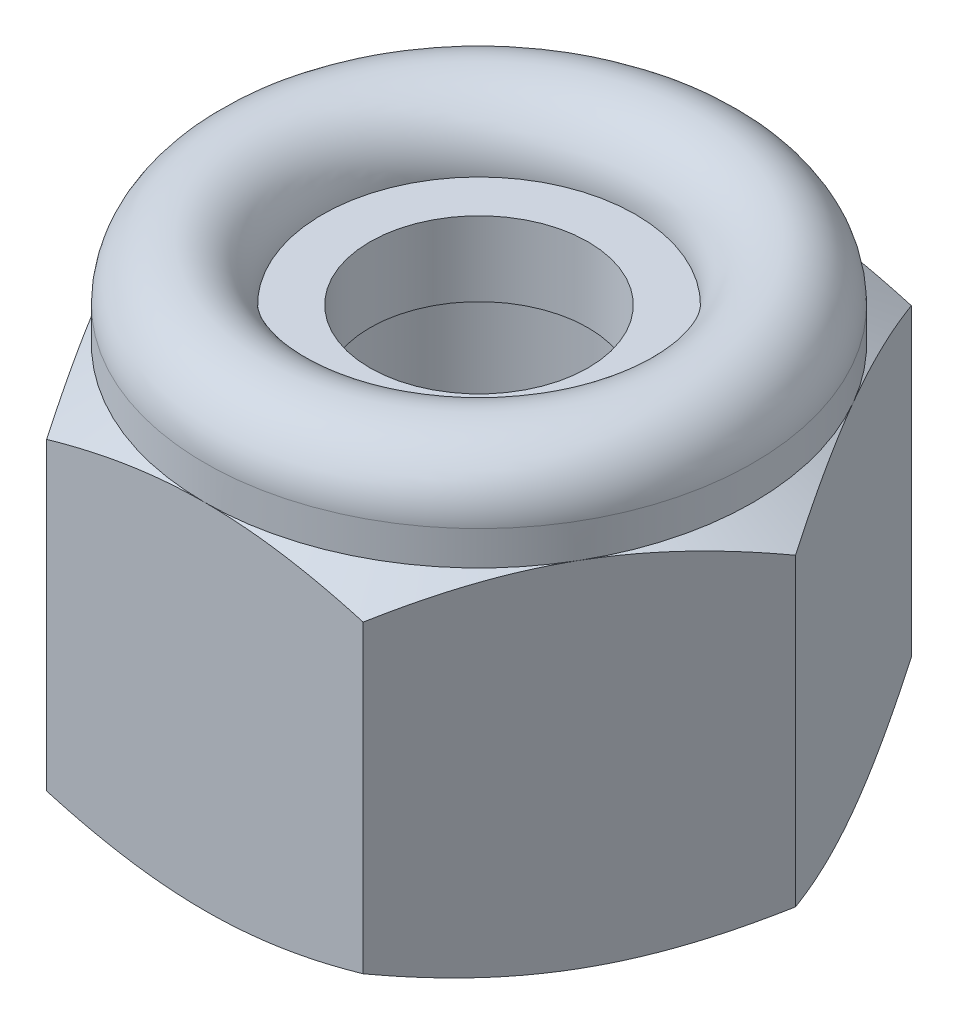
ISO-10303-21;
HEADER;
FILE_DESCRIPTION(('STEP AP214'),'2;1');
FILE_NAME('part.step','',(''),(''),'','','');
FILE_SCHEMA(('AUTOMOTIVE_DESIGN { 1 0 10303 214 1 1 1 1 }'));
ENDSEC;
DATA;
#1=APPLICATION_CONTEXT('core data for automotive mechanical design processes');
#2=APPLICATION_PROTOCOL_DEFINITION('international standard','automotive_design',2000,#1);
#3=PRODUCT_CONTEXT('',#1,'mechanical');
#4=PRODUCT('Part','Part','',(#3));
#5=PRODUCT_RELATED_PRODUCT_CATEGORY('part','',(#4));
#6=PRODUCT_DEFINITION_FORMATION('','',#4);
#7=PRODUCT_DEFINITION_CONTEXT('part definition',#1,'design');
#8=PRODUCT_DEFINITION('design','',#6,#7);
#9=PRODUCT_DEFINITION_SHAPE('','',#8);
#10=(LENGTH_UNIT() NAMED_UNIT(*) SI_UNIT(.MILLI.,.METRE.));
#11=(NAMED_UNIT(*) PLANE_ANGLE_UNIT() SI_UNIT($,.RADIAN.));
#12=(NAMED_UNIT(*) SI_UNIT($,.STERADIAN.) SOLID_ANGLE_UNIT());
#13=UNCERTAINTY_MEASURE_WITH_UNIT(LENGTH_MEASURE(1.E-05),#10,'distance_accuracy_value','');
#14=(GEOMETRIC_REPRESENTATION_CONTEXT(3) GLOBAL_UNCERTAINTY_ASSIGNED_CONTEXT((#13)) GLOBAL_UNIT_ASSIGNED_CONTEXT((#10,
#11,#12)) REPRESENTATION_CONTEXT('',''));
#15=CARTESIAN_POINT('',(0.,0.,0.));
#16=DIRECTION('',(0.,0.,1.));
#17=DIRECTION('',(1.,0.,0.));
#18=AXIS2_PLACEMENT_3D('',#15,#16,#17);
#19=CARTESIAN_POINT('',(0.,4.95,0.));
#20=DIRECTION('',(0.,-1.,0.));
#21=DIRECTION('',(0.,0.,-1.));
#22=AXIS2_PLACEMENT_3D('',#19,#20,#21);
#23=TOROIDAL_SURFACE('',#22,2.75,0.75);
#24=CARTESIAN_POINT('',(0.,4.95,0.));
#25=DIRECTION('',(0.,-1.,0.));
#26=DIRECTION('',(0.,0.,-1.));
#27=AXIS2_PLACEMENT_3D('',#24,#25,#26);
#28=CIRCLE('',#27,3.5);
#29=CARTESIAN_POINT('',(0.,4.95,-3.5));
#30=VERTEX_POINT('',#29);
#31=EDGE_CURVE('E175',#30,#30,#28,.T.);
#32=ORIENTED_EDGE('',*,*,#31,.F.);
#33=EDGE_LOOP('',(#32));
#34=FACE_BOUND('',#33,.T.);
#35=CARTESIAN_POINT('',(0.,4.95,0.));
#36=DIRECTION('',(0.,-1.,0.));
#37=DIRECTION('',(0.,0.,-1.));
#38=AXIS2_PLACEMENT_3D('',#35,#36,#37);
#39=CIRCLE('',#38,2.);
#40=CARTESIAN_POINT('',(0.,4.95,-2.));
#41=VERTEX_POINT('',#40);
#42=EDGE_CURVE('E20',#41,#41,#39,.T.);
#43=ORIENTED_EDGE('',*,*,#42,.T.);
#44=EDGE_LOOP('',(#43));
#45=FACE_BOUND('',#44,.T.);
#46=ADVANCED_FACE('F16',(#34,#45),#23,.T.);
#47=CARTESIAN_POINT('',(2.75,4.95,0.));
#48=DIRECTION('',(0.,-1.,0.));
#49=DIRECTION('',(0.,0.,-1.));
#50=AXIS2_PLACEMENT_3D('',#47,#48,#49);
#51=PLANE('',#50);
#52=CARTESIAN_POINT('',(0.,4.95,0.));
#53=DIRECTION('',(0.,-1.,0.));
#54=DIRECTION('',(0.,0.,-1.));
#55=AXIS2_PLACEMENT_3D('',#52,#53,#54);
#56=CIRCLE('',#55,1.393782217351);
#57=CARTESIAN_POINT('',(0.,4.95,-1.393782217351));
#58=VERTEX_POINT('',#57);
#59=EDGE_CURVE('E174',#58,#58,#56,.T.);
#60=ORIENTED_EDGE('',*,*,#59,.T.);
#61=EDGE_LOOP('',(#60));
#62=FACE_BOUND('',#61,.T.);
#63=ORIENTED_EDGE('',*,*,#42,.F.);
#64=EDGE_LOOP('',(#63));
#65=FACE_BOUND('',#64,.T.);
#66=ADVANCED_FACE('F386',(#62,#65),#51,.F.);
#67=CARTESIAN_POINT('',(0.,0.,0.));
#68=DIRECTION('',(0.,-1.,0.));
#69=DIRECTION('',(0.,0.,-1.));
#70=AXIS2_PLACEMENT_3D('',#67,#68,#69);
#71=CYLINDRICAL_SURFACE('',#70,3.5);
#72=CARTESIAN_POINT('',(0.,4.51443144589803,0.));
#73=DIRECTION('',(0.,-1.,0.));
#74=DIRECTION('',(0.,0.,-1.));
#75=AXIS2_PLACEMENT_3D('',#72,#73,#74);
#76=CIRCLE('',#75,3.49999999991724);
#77=CARTESIAN_POINT('',(0.,4.51443144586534,3.49999999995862));
#78=VERTEX_POINT('',#77);
#79=CARTESIAN_POINT('',(-3.03108891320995,4.51443144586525,1.74999999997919));
#80=VERTEX_POINT('',#79);
#81=EDGE_CURVE('E170',#78,#80,#76,.T.);
#82=ORIENTED_EDGE('',*,*,#81,.F.);
#83=CARTESIAN_POINT('',(0.,4.51443144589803,0.));
#84=DIRECTION('',(0.,-1.,0.));
#85=DIRECTION('',(0.,0.,-1.));
#86=AXIS2_PLACEMENT_3D('',#83,#84,#85);
#87=CIRCLE('',#86,3.49999999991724);
#88=CARTESIAN_POINT('',(3.03108891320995,4.51443144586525,1.74999999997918));
#89=VERTEX_POINT('',#88);
#90=EDGE_CURVE('E110',#89,#78,#87,.T.);
#91=ORIENTED_EDGE('',*,*,#90,.F.);
#92=CARTESIAN_POINT('',(0.,4.51443144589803,0.));
#93=DIRECTION('',(0.,-1.,0.));
#94=DIRECTION('',(0.,0.,-1.));
#95=AXIS2_PLACEMENT_3D('',#92,#93,#94);
#96=CIRCLE('',#95,3.49999999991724);
#97=CARTESIAN_POINT('',(3.03108891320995,4.51443144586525,-1.74999999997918));
#98=VERTEX_POINT('',#97);
#99=EDGE_CURVE('E162',#98,#89,#96,.T.);
#100=ORIENTED_EDGE('',*,*,#99,.F.);
#101=CARTESIAN_POINT('',(0.,4.51443144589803,0.));
#102=DIRECTION('',(0.,-1.,0.));
#103=DIRECTION('',(0.,0.,-1.));
#104=AXIS2_PLACEMENT_3D('',#101,#102,#103);
#105=CIRCLE('',#104,3.49999999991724);
#106=CARTESIAN_POINT('',(0.,4.51443144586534,-3.49999999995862));
#107=VERTEX_POINT('',#106);
#108=EDGE_CURVE('E159',#107,#98,#105,.T.);
#109=ORIENTED_EDGE('',*,*,#108,.F.);
#110=CARTESIAN_POINT('',(0.,4.51443144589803,0.));
#111=DIRECTION('',(0.,-1.,0.));
#112=DIRECTION('',(0.,0.,-1.));
#113=AXIS2_PLACEMENT_3D('',#110,#111,#112);
#114=CIRCLE('',#113,3.49999999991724);
#115=CARTESIAN_POINT('',(-3.03108891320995,4.51443144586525,-1.74999999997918));
#116=VERTEX_POINT('',#115);
#117=EDGE_CURVE('E164',#116,#107,#114,.T.);
#118=ORIENTED_EDGE('',*,*,#117,.F.);
#119=CARTESIAN_POINT('',(0.,4.51443144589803,0.));
#120=DIRECTION('',(0.,-1.,0.));
#121=DIRECTION('',(0.,0.,-1.));
#122=AXIS2_PLACEMENT_3D('',#119,#120,#121);
#123=CIRCLE('',#122,3.49999999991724);
#124=EDGE_CURVE('E167',#80,#116,#123,.T.);
#125=ORIENTED_EDGE('',*,*,#124,.F.);
#126=EDGE_LOOP('',(#82,#91,#100,#109,#118,#125));
#127=FACE_BOUND('',#126,.T.);
#128=ORIENTED_EDGE('',*,*,#31,.T.);
#129=EDGE_LOOP('',(#128));
#130=FACE_BOUND('',#129,.T.);
#131=ADVANCED_FACE('F390',(#127,#130),#71,.T.);
#132=CARTESIAN_POINT('',(0.,0.,0.));
#133=DIRECTION('',(0.,-1.,0.));
#134=DIRECTION('',(0.,0.,-1.));
#135=AXIS2_PLACEMENT_3D('',#132,#133,#134);
#136=CYLINDRICAL_SURFACE('',#135,1.393782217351);
#137=CARTESIAN_POINT('',(0.,4.,0.));
#138=DIRECTION('',(0.,-1.,0.));
#139=DIRECTION('',(0.,0.,-1.));
#140=AXIS2_PLACEMENT_3D('',#137,#138,#139);
#141=CIRCLE('',#140,1.393782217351);
#142=CARTESIAN_POINT('',(0.,4.,-1.393782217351));
#143=VERTEX_POINT('',#142);
#144=EDGE_CURVE('E123',#143,#143,#141,.F.);
#145=ORIENTED_EDGE('',*,*,#144,.F.);
#146=EDGE_LOOP('',(#145));
#147=FACE_BOUND('',#146,.T.);
#148=ORIENTED_EDGE('',*,*,#59,.F.);
#149=EDGE_LOOP('',(#148));
#150=FACE_BOUND('',#149,.T.);
#151=ADVANCED_FACE('F371',(#147,#150),#136,.F.);
#152=CARTESIAN_POINT('',(0.,4.19994841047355,0.));
#153=DIRECTION('',(0.,-1.,0.));
#154=DIRECTION('',(0.,0.,-1.));
#155=AXIS2_PLACEMENT_3D('',#152,#153,#154);
#156=CONICAL_SURFACE('',#155,4.04470059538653,1.04719755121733);
#157=ORIENTED_EDGE('',*,*,#90,.T.);
#158=CARTESIAN_POINT('',(0.,4.51443144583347,3.50000000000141));
#159=CARTESIAN_POINT('',(0.0857684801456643,4.51444575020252,3.5000000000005));
#160=CARTESIAN_POINT('',(0.171532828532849,4.51261159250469,3.50000000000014));
#161=CARTESIAN_POINT('',(0.34289312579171,4.50535267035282,3.49999999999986));
#162=CARTESIAN_POINT('',(0.428489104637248,4.49992861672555,3.49999999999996));
#163=CARTESIAN_POINT('',(0.598959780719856,4.48563193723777,3.50000000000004));
#164=CARTESIAN_POINT('',(0.683835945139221,4.4767766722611,3.50000000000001));
#165=CARTESIAN_POINT('',(0.853183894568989,4.45580805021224,3.49999999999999));
#166=CARTESIAN_POINT('',(0.937655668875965,4.44369460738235,3.5));
#167=CARTESIAN_POINT('',(1.19011426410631,4.40284122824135,3.50000000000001));
#168=CARTESIAN_POINT('',(1.35736768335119,4.36956840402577,3.5));
#169=CARTESIAN_POINT('',(1.69043621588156,4.29283276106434,3.5));
#170=CARTESIAN_POINT('',(1.85623971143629,4.24931905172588,3.49999999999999));
#171=CARTESIAN_POINT('',(2.02072594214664,4.2018240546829,3.5));
#172=B_SPLINE_CURVE_WITH_KNOTS('',3,(#158,#159,#160,#161,#162,#163,#164,#165,#166,#167,#168,
#169,#170,#171),.UNSPECIFIED.,.F.,.F.,(4,2,2,2,2,2,4),(0.,0.257279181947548,0.514507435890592,
0.770450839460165,1.026400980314,1.53763042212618,2.05145608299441),.UNSPECIFIED.);
#173=CARTESIAN_POINT('',(2.02072594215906,4.20182405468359,3.49999999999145));
#174=VERTEX_POINT('',#173);
#175=EDGE_CURVE('E104',#78,#174,#172,.T.);
#176=ORIENTED_EDGE('',*,*,#175,.T.);
#177=CARTESIAN_POINT('',(2.02072594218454,4.20182405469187,3.49999999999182));
#178=CARTESIAN_POINT('',(2.10296905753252,4.24931905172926,3.35755074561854));
#179=CARTESIAN_POINT('',(2.18587080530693,4.29283276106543,3.21396070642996));
#180=CARTESIAN_POINT('',(2.35240507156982,4.36956840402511,2.92551489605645));
#181=CARTESIAN_POINT('',(2.43603178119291,4.40284122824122,2.78066918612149));
#182=CARTESIAN_POINT('',(2.56226107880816,4.44369460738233,2.56203362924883));
#183=CARTESIAN_POINT('',(2.60449696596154,4.45580805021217,2.48887892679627));
#184=CARTESIAN_POINT('',(2.6891709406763,4.47677667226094,2.34221930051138));
#185=CARTESIAN_POINT('',(2.73160902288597,4.4856319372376,2.2687143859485));
#186=CARTESIAN_POINT('',(2.81684436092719,4.4999286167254,2.12108244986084));
#187=CARTESIAN_POINT('',(2.8596423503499,4.50535267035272,2.0469541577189));
#188=CARTESIAN_POINT('',(2.94532249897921,4.51261159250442,1.89855178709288));
#189=CARTESIAN_POINT('',(2.98820467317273,4.51444575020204,1.82427768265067));
#190=CARTESIAN_POINT('',(3.03108891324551,4.51443144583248,1.75000000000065));
#191=B_SPLINE_CURVE_WITH_KNOTS('',3,(#177,#178,#179,#180,#181,#182,#183,#184,#185,#186,#187,
#188,#189,#190),.UNSPECIFIED.,.F.,.F.,(4,2,2,2,2,2,4),(0.,0.513825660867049,1.02505510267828,
1.28100524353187,1.53694864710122,1.79417690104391,2.05145608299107),.UNSPECIFIED.);
#192=EDGE_CURVE('E107',#174,#89,#191,.T.);
#193=ORIENTED_EDGE('',*,*,#192,.T.);
#194=EDGE_LOOP('',(#157,#176,#193));
#195=FACE_BOUND('',#194,.T.);
#196=ADVANCED_FACE('F106',(#195),#156,.T.);
#197=CARTESIAN_POINT('',(0.,4.19994841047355,0.));
#198=DIRECTION('',(0.,-1.,0.));
#199=DIRECTION('',(0.,0.,-1.));
#200=AXIS2_PLACEMENT_3D('',#197,#198,#199);
#201=CONICAL_SURFACE('',#200,4.04470059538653,1.04719755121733);
#202=ORIENTED_EDGE('',*,*,#81,.T.);
#203=CARTESIAN_POINT('',(-3.03108891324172,4.51443144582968,1.74999999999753));
#204=CARTESIAN_POINT('',(-2.98820467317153,4.51444575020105,1.82427768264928));
#205=CARTESIAN_POINT('',(-2.94532249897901,4.51261159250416,1.89855178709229));
#206=CARTESIAN_POINT('',(-2.85964235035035,4.50535267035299,2.04695415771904));
#207=CARTESIAN_POINT('',(-2.81684436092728,4.49992861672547,2.12108244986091));
#208=CARTESIAN_POINT('',(-2.73160902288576,4.48563193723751,2.26871438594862));
#209=CARTESIAN_POINT('',(-2.68917094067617,4.47677667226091,2.34221930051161));
#210=CARTESIAN_POINT('',(-2.60449696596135,4.45580805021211,2.48887892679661));
#211=CARTESIAN_POINT('',(-2.56226107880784,4.4436946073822,2.56203362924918));
#212=CARTESIAN_POINT('',(-2.43603178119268,4.4028412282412,2.78066918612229));
#213=CARTESIAN_POINT('',(-2.35240507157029,4.36956840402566,2.92551489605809));
#214=CARTESIAN_POINT('',(-2.18587080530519,4.2928327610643,3.21396070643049));
#215=CARTESIAN_POINT('',(-2.10296905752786,4.24931905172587,3.35755074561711));
#216=CARTESIAN_POINT('',(-2.02072594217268,4.2018240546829,3.49999999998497));
#217=B_SPLINE_CURVE_WITH_KNOTS('',3,(#203,#204,#205,#206,#207,#208,#209,#210,#211,#212,#213,
#214,#215,#216),.UNSPECIFIED.,.F.,.F.,(4,2,2,2,2,2,4),(0.,0.257279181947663,0.514507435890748,
0.770450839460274,1.02640098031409,1.537630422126,2.05145608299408),.UNSPECIFIED.);
#218=CARTESIAN_POINT('',(-2.02072594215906,4.20182405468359,3.49999999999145));
#219=VERTEX_POINT('',#218);
#220=EDGE_CURVE('E132',#80,#219,#217,.T.);
#221=ORIENTED_EDGE('',*,*,#220,.T.);
#222=CARTESIAN_POINT('',(-2.02072594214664,4.20182405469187,3.5000000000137));
#223=CARTESIAN_POINT('',(-1.85623971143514,4.24931905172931,3.50000000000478));
#224=CARTESIAN_POINT('',(-1.69043621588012,4.29283276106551,3.50000000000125));
#225=CARTESIAN_POINT('',(-1.35736768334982,4.36956840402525,3.49999999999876));
#226=CARTESIAN_POINT('',(-1.1901142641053,4.40284122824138,3.49999999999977));
#227=CARTESIAN_POINT('',(-0.937655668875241,4.44369460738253,3.50000000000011));
#228=CARTESIAN_POINT('',(-0.85318389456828,4.45580805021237,3.50000000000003));
#229=CARTESIAN_POINT('',(-0.683835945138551,4.47677667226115,3.49999999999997));
#230=CARTESIAN_POINT('',(-0.598959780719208,4.48563193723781,3.49999999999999));
#231=CARTESIAN_POINT('',(-0.428489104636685,4.49992861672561,3.50000000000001));
#232=CARTESIAN_POINT('',(-0.342893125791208,4.50535267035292,3.5));
#233=CARTESIAN_POINT('',(-0.171532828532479,4.51261159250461,3.5));
#234=CARTESIAN_POINT('',(-0.0857684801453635,4.51444575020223,3.49999999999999));
#235=CARTESIAN_POINT('',(2.34930229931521E-13,4.51443144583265,3.5));
#236=B_SPLINE_CURVE_WITH_KNOTS('',3,(#222,#223,#224,#225,#226,#227,#228,#229,#230,#231,#232,
#233,#234,#235),.UNSPECIFIED.,.F.,.F.,(4,2,2,2,2,2,4),(0.,0.513825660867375,1.02505510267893,
1.28100524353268,1.53694864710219,1.79417690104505,2.05145608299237),.UNSPECIFIED.);
#237=EDGE_CURVE('E115',#219,#78,#236,.T.);
#238=ORIENTED_EDGE('',*,*,#237,.T.);
#239=EDGE_LOOP('',(#202,#221,#238));
#240=FACE_BOUND('',#239,.T.);
#241=ADVANCED_FACE('F370',(#240),#201,.T.);
#242=CARTESIAN_POINT('',(0.,4.19994841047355,0.));
#243=DIRECTION('',(0.,-1.,0.));
#244=DIRECTION('',(0.,0.,-1.));
#245=AXIS2_PLACEMENT_3D('',#242,#243,#244);
#246=CONICAL_SURFACE('',#245,4.04470059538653,1.04719755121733);
#247=ORIENTED_EDGE('',*,*,#124,.T.);
#248=CARTESIAN_POINT('',(-3.03108891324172,4.51443144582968,-1.74999999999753));
#249=CARTESIAN_POINT('',(-3.07397315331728,4.51444575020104,-1.67572231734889));
#250=CARTESIAN_POINT('',(-3.116855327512,4.51261159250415,-1.60144821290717));
#251=CARTESIAN_POINT('',(-3.20253547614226,4.50535267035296,-1.45304584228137));
#252=CARTESIAN_POINT('',(-3.24533346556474,4.49992861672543,-1.37891755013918));
#253=CARTESIAN_POINT('',(-3.33056880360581,4.48563193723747,-1.23128561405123));
#254=CARTESIAN_POINT('',(-3.37300688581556,4.47677667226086,-1.15778069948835));
#255=CARTESIAN_POINT('',(-3.45768086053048,4.45580805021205,-1.01112107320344));
#256=CARTESIAN_POINT('',(-3.49991674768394,4.44369460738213,-0.937966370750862));
#257=CARTESIAN_POINT('',(-3.62614604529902,4.40284122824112,-0.719330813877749));
#258=CARTESIAN_POINT('',(-3.70977275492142,4.36956840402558,-0.57448510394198));
#259=CARTESIAN_POINT('',(-3.87630702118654,4.29283276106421,-0.286039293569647));
#260=CARTESIAN_POINT('',(-3.95920876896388,4.24931905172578,-0.142449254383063));
#261=CARTESIAN_POINT('',(-4.04145188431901,4.20182405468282,-1.51997341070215E-11));
#262=B_SPLINE_CURVE_WITH_KNOTS('',3,(#248,#249,#250,#251,#252,#253,#254,#255,#256,#257,#258,
#259,#260,#261),.UNSPECIFIED.,.F.,.F.,(4,2,2,2,2,2,4),(0.,0.257279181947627,0.514507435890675,
0.770450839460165,1.02640098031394,1.53763042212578,2.05145608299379),.UNSPECIFIED.);
#263=CARTESIAN_POINT('',(-4.04145188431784,4.20182405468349,0.));
#264=VERTEX_POINT('',#263);
#265=EDGE_CURVE('E143',#116,#264,#262,.T.);
#266=ORIENTED_EDGE('',*,*,#265,.T.);
#267=CARTESIAN_POINT('',(-4.04145188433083,4.20182405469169,2.19108720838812E-11));
#268=CARTESIAN_POINT('',(-3.95920876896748,4.24931905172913,0.142449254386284));
#269=CARTESIAN_POINT('',(-3.87630702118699,4.29283276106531,0.28603929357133));
#270=CARTESIAN_POINT('',(-3.70977275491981,4.36956840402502,0.574485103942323));
#271=CARTESIAN_POINT('',(-3.62614604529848,4.40284122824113,0.719330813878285));
#272=CARTESIAN_POINT('',(-3.49991674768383,4.44369460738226,0.93796637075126));
#273=CARTESIAN_POINT('',(-3.45768086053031,4.45580805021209,1.01112107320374));
#274=CARTESIAN_POINT('',(-3.37300688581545,4.47677667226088,1.15778069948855));
#275=CARTESIAN_POINT('',(-3.33056880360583,4.48563193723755,1.23128561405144));
#276=CARTESIAN_POINT('',(-3.24533346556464,4.49992861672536,1.37891755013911));
#277=CARTESIAN_POINT('',(-3.20253547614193,4.50535267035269,1.45304584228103));
#278=CARTESIAN_POINT('',(-3.11685532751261,4.5126115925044,1.60144821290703));
#279=CARTESIAN_POINT('',(-3.07397315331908,4.51444575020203,1.67572231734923));
#280=CARTESIAN_POINT('',(-3.03108891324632,4.51443144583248,1.74999999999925));
#281=B_SPLINE_CURVE_WITH_KNOTS('',3,(#267,#268,#269,#270,#271,#272,#273,#274,#275,#276,#277,
#278,#279,#280),.UNSPECIFIED.,.F.,.F.,(4,2,2,2,2,2,4),(0.,0.513825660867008,1.0250551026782,
1.28100524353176,1.53694864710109,1.79417690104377,2.0514560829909),.UNSPECIFIED.);
#282=EDGE_CURVE('E129',#264,#80,#281,.T.);
#283=ORIENTED_EDGE('',*,*,#282,.T.);
#284=EDGE_LOOP('',(#247,#266,#283));
#285=FACE_BOUND('',#284,.T.);
#286=ADVANCED_FACE('F515',(#285),#246,.T.);
#287=CARTESIAN_POINT('',(0.,4.19994841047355,0.));
#288=DIRECTION('',(0.,-1.,0.));
#289=DIRECTION('',(0.,0.,-1.));
#290=AXIS2_PLACEMENT_3D('',#287,#288,#289);
#291=CONICAL_SURFACE('',#290,4.04470059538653,1.04719755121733);
#292=CARTESIAN_POINT('',(0.,4.51443144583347,-3.50000000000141));
#293=CARTESIAN_POINT('',(-0.0857684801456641,4.51444575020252,-3.5000000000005));
#294=CARTESIAN_POINT('',(-0.171532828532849,4.51261159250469,-3.50000000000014));
#295=CARTESIAN_POINT('',(-0.34289312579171,4.50535267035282,-3.49999999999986));
#296=CARTESIAN_POINT('',(-0.428489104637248,4.49992861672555,-3.49999999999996));
#297=CARTESIAN_POINT('',(-0.598959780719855,4.48563193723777,-3.50000000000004));
#298=CARTESIAN_POINT('',(-0.683835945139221,4.4767766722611,-3.50000000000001));
#299=CARTESIAN_POINT('',(-0.853183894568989,4.45580805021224,-3.49999999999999));
#300=CARTESIAN_POINT('',(-0.937655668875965,4.44369460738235,-3.5));
#301=CARTESIAN_POINT('',(-1.19011426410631,4.40284122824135,-3.50000000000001));
#302=CARTESIAN_POINT('',(-1.35736768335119,4.36956840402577,-3.5));
#303=CARTESIAN_POINT('',(-1.69043621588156,4.29283276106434,-3.5));
#304=CARTESIAN_POINT('',(-1.85623971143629,4.24931905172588,-3.49999999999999));
#305=CARTESIAN_POINT('',(-2.02072594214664,4.2018240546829,-3.5));
#306=B_SPLINE_CURVE_WITH_KNOTS('',3,(#292,#293,#294,#295,#296,#297,#298,#299,#300,#301,#302,
#303,#304,#305),.UNSPECIFIED.,.F.,.F.,(4,2,2,2,2,2,4),(0.,0.257279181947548,0.514507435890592,
0.770450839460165,1.026400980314,1.53763042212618,2.05145608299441),.UNSPECIFIED.);
#307=CARTESIAN_POINT('',(-2.02072594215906,4.20182405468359,-3.49999999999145));
#308=VERTEX_POINT('',#307);
#309=EDGE_CURVE('E147',#107,#308,#306,.T.);
#310=ORIENTED_EDGE('',*,*,#309,.T.);
#311=CARTESIAN_POINT('',(-2.02072594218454,4.20182405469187,-3.49999999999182));
#312=CARTESIAN_POINT('',(-2.10296905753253,4.24931905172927,-3.35755074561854));
#313=CARTESIAN_POINT('',(-2.18587080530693,4.29283276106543,-3.21396070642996));
#314=CARTESIAN_POINT('',(-2.35240507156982,4.36956840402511,-2.92551489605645));
#315=CARTESIAN_POINT('',(-2.43603178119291,4.40284122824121,-2.78066918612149));
#316=CARTESIAN_POINT('',(-2.56226107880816,4.44369460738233,-2.56203362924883));
#317=CARTESIAN_POINT('',(-2.60449696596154,4.45580805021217,-2.48887892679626));
#318=CARTESIAN_POINT('',(-2.6891709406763,4.47677667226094,-2.34221930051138));
#319=CARTESIAN_POINT('',(-2.73160902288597,4.4856319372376,-2.2687143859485));
#320=CARTESIAN_POINT('',(-2.81684436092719,4.4999286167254,-2.12108244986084));
#321=CARTESIAN_POINT('',(-2.8596423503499,4.50535267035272,-2.0469541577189));
#322=CARTESIAN_POINT('',(-2.94532249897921,4.51261159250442,-1.89855178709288));
#323=CARTESIAN_POINT('',(-2.98820467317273,4.51444575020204,-1.82427768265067));
#324=CARTESIAN_POINT('',(-3.03108891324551,4.51443144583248,-1.75000000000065));
#325=B_SPLINE_CURVE_WITH_KNOTS('',3,(#311,#312,#313,#314,#315,#316,#317,#318,#319,#320,#321,
#322,#323,#324),.UNSPECIFIED.,.F.,.F.,(4,2,2,2,2,2,4),(0.,0.513825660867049,1.02505510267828,
1.28100524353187,1.53694864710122,1.79417690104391,2.05145608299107),.UNSPECIFIED.);
#326=EDGE_CURVE('E139',#308,#116,#325,.T.);
#327=ORIENTED_EDGE('',*,*,#326,.T.);
#328=ORIENTED_EDGE('',*,*,#117,.T.);
#329=EDGE_LOOP('',(#310,#327,#328));
#330=FACE_BOUND('',#329,.T.);
#331=ADVANCED_FACE('F505',(#330),#291,.T.);
#332=CARTESIAN_POINT('',(0.,4.19994841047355,0.));
#333=DIRECTION('',(0.,-1.,0.));
#334=DIRECTION('',(0.,0.,-1.));
#335=AXIS2_PLACEMENT_3D('',#332,#333,#334);
#336=CONICAL_SURFACE('',#335,4.04470059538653,1.04719755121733);
#337=CARTESIAN_POINT('',(3.03108891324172,4.51443144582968,1.74999999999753));
#338=CARTESIAN_POINT('',(3.07397315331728,4.51444575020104,1.67572231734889));
#339=CARTESIAN_POINT('',(3.11685532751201,4.51261159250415,1.60144821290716));
#340=CARTESIAN_POINT('',(3.20253547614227,4.50535267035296,1.45304584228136));
#341=CARTESIAN_POINT('',(3.24533346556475,4.49992861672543,1.37891755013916));
#342=CARTESIAN_POINT('',(3.33056880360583,4.48563193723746,1.23128561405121));
#343=CARTESIAN_POINT('',(3.37300688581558,4.47677667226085,1.15778069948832));
#344=CARTESIAN_POINT('',(3.45768086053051,4.45580805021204,1.0111210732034));
#345=CARTESIAN_POINT('',(3.49991674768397,4.44369460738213,0.93796637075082));
#346=CARTESIAN_POINT('',(3.62614604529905,4.40284122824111,0.719330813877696));
#347=CARTESIAN_POINT('',(3.70977275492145,4.36956840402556,0.57448510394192));
#348=CARTESIAN_POINT('',(3.87630702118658,4.29283276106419,0.286039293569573));
#349=CARTESIAN_POINT('',(3.95920876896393,4.24931905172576,0.142449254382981));
#350=CARTESIAN_POINT('',(4.04145188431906,4.20182405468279,1.51111374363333E-11));
#351=B_SPLINE_CURVE_WITH_KNOTS('',3,(#337,#338,#339,#340,#341,#342,#343,#344,#345,#346,#347,
#348,#349,#350),.UNSPECIFIED.,.F.,.F.,(4,2,2,2,2,2,4),(0.,0.25727918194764,0.514507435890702,
0.770450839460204,1.026400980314,1.53763042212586,2.05145608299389),.UNSPECIFIED.);
#352=CARTESIAN_POINT('',(4.04145188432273,4.20182405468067,8.41392454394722E-12));
#353=VERTEX_POINT('',#352);
#354=EDGE_CURVE('E122',#89,#353,#351,.T.);
#355=ORIENTED_EDGE('',*,*,#354,.T.);
#356=CARTESIAN_POINT('',(4.04145188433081,4.20182405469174,-2.20158946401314E-11));
#357=CARTESIAN_POINT('',(3.95920876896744,4.24931905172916,-0.142449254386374));
#358=CARTESIAN_POINT('',(3.87630702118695,4.29283276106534,-0.286039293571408));
#359=CARTESIAN_POINT('',(3.70977275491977,4.36956840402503,-0.574485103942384));
#360=CARTESIAN_POINT('',(3.62614604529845,4.40284122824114,-0.719330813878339));
#361=CARTESIAN_POINT('',(3.49991674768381,4.44369460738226,-0.937966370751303));
#362=CARTESIAN_POINT('',(3.45768086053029,4.4558080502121,-1.01112107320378));
#363=CARTESIAN_POINT('',(3.37300688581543,4.47677667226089,-1.15778069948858));
#364=CARTESIAN_POINT('',(3.33056880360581,4.48563193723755,-1.23128561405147));
#365=CARTESIAN_POINT('',(3.24533346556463,4.49992861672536,-1.37891755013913));
#366=CARTESIAN_POINT('',(3.20253547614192,4.50535267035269,-1.45304584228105));
#367=CARTESIAN_POINT('',(3.11685532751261,4.5126115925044,-1.60144821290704));
#368=CARTESIAN_POINT('',(3.07397315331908,4.51444575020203,-1.67572231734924));
#369=CARTESIAN_POINT('',(3.03108891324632,4.51443144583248,-1.74999999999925));
#370=B_SPLINE_CURVE_WITH_KNOTS('',3,(#356,#357,#358,#359,#360,#361,#362,#363,#364,#365,#366,
#367,#368,#369),.UNSPECIFIED.,.F.,.F.,(4,2,2,2,2,2,4),(0.,0.513825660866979,1.02505510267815,
1.28100524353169,1.53694864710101,1.79417690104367,2.05145608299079),.UNSPECIFIED.);
#371=EDGE_CURVE('E153',#353,#98,#370,.T.);
#372=ORIENTED_EDGE('',*,*,#371,.T.);
#373=ORIENTED_EDGE('',*,*,#99,.T.);
#374=EDGE_LOOP('',(#355,#372,#373));
#375=FACE_BOUND('',#374,.T.);
#376=ADVANCED_FACE('F264',(#375),#336,.T.);
#377=CARTESIAN_POINT('',(0.,4.19994841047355,0.));
#378=DIRECTION('',(0.,-1.,0.));
#379=DIRECTION('',(0.,0.,-1.));
#380=AXIS2_PLACEMENT_3D('',#377,#378,#379);
#381=CONICAL_SURFACE('',#380,4.04470059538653,1.04719755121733);
#382=CARTESIAN_POINT('',(3.03108891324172,4.51443144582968,-1.74999999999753));
#383=CARTESIAN_POINT('',(2.98820467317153,4.51444575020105,-1.82427768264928));
#384=CARTESIAN_POINT('',(2.94532249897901,4.51261159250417,-1.89855178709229));
#385=CARTESIAN_POINT('',(2.85964235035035,4.50535267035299,-2.04695415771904));
#386=CARTESIAN_POINT('',(2.81684436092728,4.49992861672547,-2.12108244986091));
#387=CARTESIAN_POINT('',(2.73160902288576,4.48563193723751,-2.26871438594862));
#388=CARTESIAN_POINT('',(2.68917094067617,4.47677667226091,-2.34221930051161));
#389=CARTESIAN_POINT('',(2.60449696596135,4.45580805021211,-2.48887892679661));
#390=CARTESIAN_POINT('',(2.56226107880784,4.4436946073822,-2.56203362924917));
#391=CARTESIAN_POINT('',(2.43603178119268,4.4028412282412,-2.78066918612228));
#392=CARTESIAN_POINT('',(2.35240507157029,4.36956840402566,-2.92551489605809));
#393=CARTESIAN_POINT('',(2.18587080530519,4.2928327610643,-3.21396070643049));
#394=CARTESIAN_POINT('',(2.10296905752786,4.24931905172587,-3.35755074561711));
#395=CARTESIAN_POINT('',(2.02072594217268,4.2018240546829,-3.49999999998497));
#396=B_SPLINE_CURVE_WITH_KNOTS('',3,(#382,#383,#384,#385,#386,#387,#388,#389,#390,#391,#392,
#393,#394,#395),.UNSPECIFIED.,.F.,.F.,(4,2,2,2,2,2,4),(0.,0.257279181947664,0.514507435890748,
0.770450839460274,1.02640098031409,1.537630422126,2.05145608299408),.UNSPECIFIED.);
#397=CARTESIAN_POINT('',(2.02072594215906,4.20182405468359,-3.49999999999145));
#398=VERTEX_POINT('',#397);
#399=EDGE_CURVE('E151',#98,#398,#396,.T.);
#400=ORIENTED_EDGE('',*,*,#399,.T.);
#401=CARTESIAN_POINT('',(2.02072594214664,4.20182405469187,-3.5000000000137));
#402=CARTESIAN_POINT('',(1.85623971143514,4.24931905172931,-3.50000000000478));
#403=CARTESIAN_POINT('',(1.69043621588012,4.29283276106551,-3.50000000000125));
#404=CARTESIAN_POINT('',(1.35736768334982,4.36956840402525,-3.49999999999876));
#405=CARTESIAN_POINT('',(1.1901142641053,4.40284122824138,-3.49999999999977));
#406=CARTESIAN_POINT('',(0.937655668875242,4.44369460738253,-3.50000000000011));
#407=CARTESIAN_POINT('',(0.853183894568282,4.45580805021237,-3.50000000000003));
#408=CARTESIAN_POINT('',(0.683835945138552,4.47677667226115,-3.49999999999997));
#409=CARTESIAN_POINT('',(0.598959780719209,4.48563193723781,-3.49999999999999));
#410=CARTESIAN_POINT('',(0.428489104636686,4.49992861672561,-3.50000000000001));
#411=CARTESIAN_POINT('',(0.342893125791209,4.50535267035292,-3.5));
#412=CARTESIAN_POINT('',(0.17153282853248,4.51261159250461,-3.5));
#413=CARTESIAN_POINT('',(0.0857684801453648,4.51444575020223,-3.49999999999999));
#414=CARTESIAN_POINT('',(-2.33850580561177E-13,4.51443144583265,-3.5));
#415=B_SPLINE_CURVE_WITH_KNOTS('',3,(#401,#402,#403,#404,#405,#406,#407,#408,#409,#410,#411,
#412,#413,#414),.UNSPECIFIED.,.F.,.F.,(4,2,2,2,2,2,4),(0.,0.513825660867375,1.02505510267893,
1.28100524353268,1.53694864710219,1.79417690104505,2.05145608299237),.UNSPECIFIED.);
#416=EDGE_CURVE('E142',#398,#107,#415,.T.);
#417=ORIENTED_EDGE('',*,*,#416,.T.);
#418=ORIENTED_EDGE('',*,*,#108,.T.);
#419=EDGE_LOOP('',(#400,#417,#418));
#420=FACE_BOUND('',#419,.T.);
#421=ADVANCED_FACE('F259',(#420),#381,.T.);
#422=CARTESIAN_POINT('',(0.,4.,0.));
#423=DIRECTION('',(0.,-1.,0.));
#424=DIRECTION('',(0.,0.,-1.));
#425=AXIS2_PLACEMENT_3D('',#422,#423,#424);
#426=PLANE('',#425);
#427=ORIENTED_EDGE('',*,*,#144,.T.);
#428=EDGE_LOOP('',(#427));
#429=FACE_BOUND('',#428,.T.);
#430=CARTESIAN_POINT('',(0.,4.,0.));
#431=DIRECTION('',(0.,-1.,0.));
#432=DIRECTION('',(0.,0.,-1.));
#433=AXIS2_PLACEMENT_3D('',#430,#431,#432);
#434=CIRCLE('',#433,1.65);
#435=CARTESIAN_POINT('',(0.,4.,-1.65));
#436=VERTEX_POINT('',#435);
#437=EDGE_CURVE('E150',#436,#436,#434,.T.);
#438=ORIENTED_EDGE('',*,*,#437,.T.);
#439=EDGE_LOOP('',(#438));
#440=FACE_BOUND('',#439,.T.);
#441=ADVANCED_FACE('F263',(#429,#440),#426,.T.);
#442=CARTESIAN_POINT('',(2.020725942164,5.7,3.5));
#443=DIRECTION('',(-0.866025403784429,0.,-0.500000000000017));
#444=DIRECTION('',(-0.500000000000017,0.,0.866025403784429));
#445=AXIS2_PLACEMENT_3D('',#442,#443,#444);
#446=PLANE('',#445);
#447=DIRECTION('',(0.,1.,0.));
#448=VECTOR('',#447,1.);
#449=CARTESIAN_POINT('',(4.04145188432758,5.7,-3.37837396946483E-13));
#450=LINE('',#449,#448);
#451=CARTESIAN_POINT('',(4.04145186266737,0.312607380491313,3.75165958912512E-08));
#452=VERTEX_POINT('',#451);
#453=EDGE_CURVE('E146',#452,#353,#450,.T.);
#454=ORIENTED_EDGE('',*,*,#453,.T.);
#455=ORIENTED_EDGE('',*,*,#354,.F.);
#456=ORIENTED_EDGE('',*,*,#192,.F.);
#457=DIRECTION('',(0.,1.,0.));
#458=VECTOR('',#457,1.);
#459=CARTESIAN_POINT('',(2.020725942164,5.7,3.5));
#460=LINE('',#459,#458);
#461=CARTESIAN_POINT('',(2.02072595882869,0.31260739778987,3.5));
#462=VERTEX_POINT('',#461);
#463=EDGE_CURVE('E114',#174,#462,#460,.F.);
#464=ORIENTED_EDGE('',*,*,#463,.T.);
#465=CARTESIAN_POINT('',(3.03108891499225,-4.9321137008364E-09,1.75000000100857));
#466=CARTESIAN_POINT('',(2.98820467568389,-1.43085537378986E-05,1.8242776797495));
#467=CARTESIAN_POINT('',(2.94532250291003,0.00181984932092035,1.89855178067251));
#468=CARTESIAN_POINT('',(2.85964235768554,0.00907877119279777,2.04695414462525));
#469=CARTESIAN_POINT('',(2.81684437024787,0.0145028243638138,2.12108243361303));
#470=CARTESIAN_POINT('',(2.73160903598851,0.0287995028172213,2.26871436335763));
#471=CARTESIAN_POINT('',(2.68917095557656,0.0376547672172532,2.34221927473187));
#472=CARTESIAN_POINT('',(2.60449698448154,0.0586233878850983,2.4888788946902));
#473=CARTESIAN_POINT('',(2.56226109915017,0.070736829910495,2.56203359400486));
#474=CARTESIAN_POINT('',(2.43603180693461,0.111590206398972,2.78066914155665));
#475=CARTESIAN_POINT('',(2.35240510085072,0.144863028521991,2.92551484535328));
#476=CARTESIAN_POINT('',(2.18587084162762,0.221598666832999,3.21396064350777));
#477=CARTESIAN_POINT('',(2.10296909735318,0.2651123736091,3.35755067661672));
#478=CARTESIAN_POINT('',(2.02072598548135,0.312607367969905,3.49999992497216));
#479=B_SPLINE_CURVE_WITH_KNOTS('',3,(#465,#466,#467,#468,#469,#470,#471,#472,#473,#474,#475,
#476,#477,#478),.UNSPECIFIED.,.F.,.F.,(4,2,2,2,2,2,4),(0.,0.257279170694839,0.514507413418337,
0.77045080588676,1.02640093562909,1.53763035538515,2.0514559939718),.UNSPECIFIED.);
#480=CARTESIAN_POINT('',(3.031088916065,-1.88828992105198E-09,1.75000000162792));
#481=VERTEX_POINT('',#480);
#482=EDGE_CURVE('E576',#481,#462,#479,.T.);
#483=ORIENTED_EDGE('',*,*,#482,.F.);
#484=CARTESIAN_POINT('',(4.04145184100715,0.312607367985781,7.50335295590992E-08));
#485=CARTESIAN_POINT('',(3.95920872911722,0.265112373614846,0.142449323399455));
#486=CARTESIAN_POINT('',(3.87630698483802,0.221598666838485,0.28603935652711));
#487=CARTESIAN_POINT('',(3.70977272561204,0.144863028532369,0.574485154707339));
#488=CARTESIAN_POINT('',(3.62614601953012,0.111590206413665,0.719330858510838));
#489=CARTESIAN_POINT('',(3.49991672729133,0.0707368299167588,0.937966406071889));
#490=CARTESIAN_POINT('',(3.45768084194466,0.058623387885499,1.01112110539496));
#491=CARTESIAN_POINT('',(3.37300687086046,0.037654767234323,1.1577807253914));
#492=CARTESIAN_POINT('',(3.33056879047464,0.0287995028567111,1.23128563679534));
#493=CARTESIAN_POINT('',(3.24533345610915,0.0145028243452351,1.37891756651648));
#494=CARTESIAN_POINT('',(3.20253546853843,0.00907877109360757,1.45304585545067));
#495=CARTESIAN_POINT('',(3.11685532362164,0.00181984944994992,1.60144821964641));
#496=CARTESIAN_POINT('',(3.07397315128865,-1.43081154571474E-05,1.67572232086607));
#497=CARTESIAN_POINT('',(3.03108891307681,-3.7431297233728E-09,1.75000000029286));
#498=B_SPLINE_CURVE_WITH_KNOTS('',3,(#484,#485,#486,#487,#488,#489,#490,#491,#492,#493,#494,
#495,#496,#497),.UNSPECIFIED.,.F.,.F.,(4,2,2,2,2,2,4),(0.,0.513825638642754,1.0250550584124,
1.28100518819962,1.53694858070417,1.79417682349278,2.0514559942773),.UNSPECIFIED.);
#499=EDGE_CURVE('E237',#452,#481,#498,.T.);
#500=ORIENTED_EDGE('',*,*,#499,.F.);
#501=EDGE_LOOP('',(#454,#455,#456,#464,#483,#500));
#502=FACE_BOUND('',#501,.T.);
#503=ADVANCED_FACE('F120',(#502),#446,.F.);
#504=CARTESIAN_POINT('',(-2.020725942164,5.7,3.5));
#505=DIRECTION('',(0.,0.,-1.));
#506=DIRECTION('',(-1.,0.,0.));
#507=AXIS2_PLACEMENT_3D('',#504,#505,#506);
#508=PLANE('',#507);
#509=ORIENTED_EDGE('',*,*,#463,.F.);
#510=ORIENTED_EDGE('',*,*,#175,.F.);
#511=ORIENTED_EDGE('',*,*,#237,.F.);
#512=DIRECTION('',(0.,1.,0.));
#513=VECTOR('',#512,1.);
#514=CARTESIAN_POINT('',(-2.020725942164,5.7,3.5));
#515=LINE('',#514,#513);
#516=CARTESIAN_POINT('',(-2.02072593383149,0.312607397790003,3.50000001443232));
#517=VERTEX_POINT('',#516);
#518=EDGE_CURVE('E137',#219,#517,#515,.F.);
#519=ORIENTED_EDGE('',*,*,#518,.T.);
#520=CARTESIAN_POINT('',(0.,-4.88895138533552E-09,3.50000000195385));
#521=CARTESIAN_POINT('',(-0.0857684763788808,-1.43085338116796E-05,3.50000000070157));
#522=CARTESIAN_POINT('',(-0.171532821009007,0.00181984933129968,3.50000000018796));
#523=CARTESIAN_POINT('',(-0.34289311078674,0.00907877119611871,3.49999999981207));
#524=CARTESIAN_POINT('',(-0.428489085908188,0.0145028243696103,3.49999999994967));
#525=CARTESIAN_POINT('',(-0.598959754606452,0.0287995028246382,3.50000000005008));
#526=CARTESIAN_POINT('',(-0.683835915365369,0.0376547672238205,3.50000000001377));
#527=CARTESIAN_POINT('',(-0.85318385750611,0.0586233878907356,3.49999999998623));
#528=CARTESIAN_POINT('',(-0.937655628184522,0.0707368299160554,3.49999999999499));
#529=CARTESIAN_POINT('',(-1.19011421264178,0.111590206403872,3.50000000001));
#530=CARTESIAN_POINT('',(-1.35736762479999,0.144863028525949,3.50000000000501));
#531=CARTESIAN_POINT('',(-1.69043614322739,0.221598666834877,3.49999999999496));
#532=CARTESIAN_POINT('',(-1.85623963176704,0.265112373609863,3.4999999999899));
#533=CARTESIAN_POINT('',(-2.02072585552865,0.312607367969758,3.5));
#534=B_SPLINE_CURVE_WITH_KNOTS('',3,(#520,#521,#522,#523,#524,#525,#526,#527,#528,#529,#530,
#531,#532,#533),.UNSPECIFIED.,.F.,.F.,(4,2,2,2,2,2,4),(0.,0.257279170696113,0.514507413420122,
0.770450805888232,1.02640093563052,1.53763035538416,2.05145599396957),.UNSPECIFIED.);
#535=CARTESIAN_POINT('',(0.,-2.22943901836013E-09,3.50000000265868));
#536=VERTEX_POINT('',#535);
#537=EDGE_CURVE('E334',#536,#517,#534,.T.);
#538=ORIENTED_EDGE('',*,*,#537,.F.);
#539=CARTESIAN_POINT('',(2.02072597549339,0.312607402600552,3.5));
#540=CARTESIAN_POINT('',(1.85623974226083,0.265112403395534,3.5));
#541=CARTESIAN_POINT('',(1.6904362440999,0.221598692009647,3.5));
#542=CARTESIAN_POINT('',(1.3573677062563,0.144863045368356,3.5));
#543=CARTESIAN_POINT('',(1.1901142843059,0.111590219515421,3.5));
#544=CARTESIAN_POINT('',(0.937655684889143,0.0707368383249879,3.5));
#545=CARTESIAN_POINT('',(0.853183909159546,0.0586233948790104,3.5));
#546=CARTESIAN_POINT('',(0.683835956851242,0.0376547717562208,3.5));
#547=CARTESIAN_POINT('',(0.598959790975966,0.0287995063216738,3.5));
#548=CARTESIAN_POINT('',(0.428489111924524,0.0145028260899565,3.5));
#549=CARTESIAN_POINT('',(0.342893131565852,0.00907877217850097,3.5));
#550=CARTESIAN_POINT('',(0.171532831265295,0.00181984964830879,3.5));
#551=CARTESIAN_POINT('',(0.0857684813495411,-1.43081435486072E-05,3.5));
#552=CARTESIAN_POINT('',(-3.25131343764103E-10,-3.76796331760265E-09,3.5));
#553=B_SPLINE_CURVE_WITH_KNOTS('',3,(#539,#540,#541,#542,#543,#544,#545,#546,#547,#548,#549,
#550,#551,#552),.UNSPECIFIED.,.F.,.F.,(4,2,2,2,2,2,4),(0.,0.513825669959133,1.02505512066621,
1.28100526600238,1.53694867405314,1.79417693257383,2.05145611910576),.UNSPECIFIED.);
#554=EDGE_CURVE('E127',#462,#536,#553,.T.);
#555=ORIENTED_EDGE('',*,*,#554,.F.);
#556=EDGE_LOOP('',(#509,#510,#511,#519,#538,#555));
#557=FACE_BOUND('',#556,.T.);
#558=ADVANCED_FACE('F125',(#557),#508,.F.);
#559=CARTESIAN_POINT('',(-2.020725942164,5.7,3.5));
#560=DIRECTION('',(0.866025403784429,0.,-0.500000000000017));
#561=DIRECTION('',(-0.500000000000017,0.,-0.866025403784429));
#562=AXIS2_PLACEMENT_3D('',#559,#560,#561);
#563=PLANE('',#562);
#564=ORIENTED_EDGE('',*,*,#518,.F.);
#565=ORIENTED_EDGE('',*,*,#220,.F.);
#566=ORIENTED_EDGE('',*,*,#282,.F.);
#567=DIRECTION('',(0.,1.,0.));
#568=VECTOR('',#567,1.);
#569=CARTESIAN_POINT('',(-4.04145188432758,5.7,-3.37837396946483E-13));
#570=LINE('',#569,#568);
#571=CARTESIAN_POINT('',(-4.04145189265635,0.312607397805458,1.44254996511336E-08));
#572=VERTEX_POINT('',#571);
#573=EDGE_CURVE('E140',#264,#572,#570,.F.);
#574=ORIENTED_EDGE('',*,*,#573,.T.);
#575=CARTESIAN_POINT('',(-3.03108891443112,-4.56946868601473E-09,1.75000000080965));
#576=CARTESIAN_POINT('',(-3.07397315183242,-1.4308409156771E-05,1.67572232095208));
#577=CARTESIAN_POINT('',(-3.11685532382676,0.00181984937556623,1.60144821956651));
#578=CARTESIAN_POINT('',(-3.20253546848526,0.00907877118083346,1.45304585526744));
#579=CARTESIAN_POINT('',(-3.24533345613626,0.0145028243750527,1.37891756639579));
#580=CARTESIAN_POINT('',(-3.33056879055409,0.0287995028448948,1.2312856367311));
#581=CARTESIAN_POINT('',(-3.37300687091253,0.0376547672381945,1.15778072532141));
#582=CARTESIAN_POINT('',(-3.45768084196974,0.0586233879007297,1.01112110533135));
#583=CARTESIAN_POINT('',(-3.49991672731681,0.0707368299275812,0.937966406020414));
#584=CARTESIAN_POINT('',(-3.6261460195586,0.111590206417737,0.719330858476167));
#585=CARTESIAN_POINT('',(-3.7097727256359,0.144863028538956,0.574485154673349));
#586=CARTESIAN_POINT('',(-3.87630698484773,0.221598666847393,0.286039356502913));
#587=CARTESIAN_POINT('',(-3.95920872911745,0.265112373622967,0.142449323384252));
#588=CARTESIAN_POINT('',(-4.0414518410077,0.312607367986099,7.50325771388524E-08));
#589=B_SPLINE_CURVE_WITH_KNOTS('',3,(#575,#576,#577,#578,#579,#580,#581,#582,#583,#584,#585,
#586,#587,#588),.UNSPECIFIED.,.F.,.F.,(4,2,2,2,2,2,4),(0.,0.257279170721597,0.514507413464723,
0.770450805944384,1.02640093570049,1.53763035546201,2.05145599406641),.UNSPECIFIED.);
#590=CARTESIAN_POINT('',(-3.03108891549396,-2.217022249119E-09,1.75000000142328));
#591=VERTEX_POINT('',#590);
#592=EDGE_CURVE('E310',#591,#572,#589,.T.);
#593=ORIENTED_EDGE('',*,*,#592,.F.);
#594=CARTESIAN_POINT('',(-2.02072592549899,0.312607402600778,3.50000002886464));
#595=CARTESIAN_POINT('',(-2.10296904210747,0.265112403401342,3.35755077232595));
#596=CARTESIAN_POINT('',(-2.18587079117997,0.221598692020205,3.21396073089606));
#597=CARTESIAN_POINT('',(-2.35240506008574,0.144863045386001,2.92551491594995));
#598=CARTESIAN_POINT('',(-2.43603177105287,0.11159021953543,2.780669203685));
#599=CARTESIAN_POINT('',(-2.562261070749,0.0707368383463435,2.56203364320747));
#600=CARTESIAN_POINT('',(-2.60449695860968,0.0586233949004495,2.48887893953));
#601=CARTESIAN_POINT('',(-2.68917093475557,0.0376547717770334,2.34221931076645));
#602=CARTESIAN_POINT('',(-2.73160901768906,0.0287995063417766,2.26871439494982));
#603=CARTESIAN_POINT('',(-2.81684435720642,0.0145028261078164,2.12108245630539));
#604=CARTESIAN_POINT('',(-2.85964234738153,0.00907877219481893,2.04695416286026));
#605=CARTESIAN_POINT('',(-2.94532249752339,0.00181984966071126,1.89855178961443));
#606=CARTESIAN_POINT('',(-2.98820467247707,-1.4308133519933E-05,1.8242776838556));
#607=CARTESIAN_POINT('',(-3.03108891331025,-3.76071716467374E-09,1.74999999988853));
#608=B_SPLINE_CURVE_WITH_KNOTS('',3,(#594,#595,#596,#597,#598,#599,#600,#601,#602,#603,#604,
#605,#606,#607),.UNSPECIFIED.,.F.,.F.,(4,2,2,2,2,2,4),(0.,0.513825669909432,1.02505512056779,
1.28100526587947,1.53694867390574,1.79417693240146,2.0514561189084),.UNSPECIFIED.);
#609=EDGE_CURVE('E329',#517,#591,#608,.T.);
#610=ORIENTED_EDGE('',*,*,#609,.F.);
#611=EDGE_LOOP('',(#564,#565,#566,#574,#593,#610));
#612=FACE_BOUND('',#611,.T.);
#613=ADVANCED_FACE('F347',(#612),#563,.F.);
#614=CARTESIAN_POINT('',(-2.020725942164,5.7,-3.5));
#615=DIRECTION('',(0.866025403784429,0.,0.500000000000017));
#616=DIRECTION('',(0.500000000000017,0.,-0.866025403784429));
#617=AXIS2_PLACEMENT_3D('',#614,#615,#616);
#618=PLANE('',#617);
#619=ORIENTED_EDGE('',*,*,#573,.F.);
#620=ORIENTED_EDGE('',*,*,#265,.F.);
#621=ORIENTED_EDGE('',*,*,#326,.F.);
#622=DIRECTION('',(0.,1.,0.));
#623=VECTOR('',#622,1.);
#624=CARTESIAN_POINT('',(-2.020725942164,5.7,-3.5));
#625=LINE('',#624,#623);
#626=CARTESIAN_POINT('',(-2.02072595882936,0.312607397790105,-3.5));
#627=VERTEX_POINT('',#626);
#628=EDGE_CURVE('E144',#308,#627,#625,.F.);
#629=ORIENTED_EDGE('',*,*,#628,.T.);
#630=CARTESIAN_POINT('',(-3.0310889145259,-4.5826018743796E-09,-1.75000000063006));
#631=CARTESIAN_POINT('',(-2.98820467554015,-1.43084249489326E-05,-1.82427767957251));
#632=CARTESIAN_POINT('',(-2.94532250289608,0.00181984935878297,-1.89855178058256));
#633=CARTESIAN_POINT('',(-2.85964235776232,0.00907877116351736,-2.04695414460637));
#634=CARTESIAN_POINT('',(-2.81684437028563,0.0145028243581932,-2.12108243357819));
#635=CARTESIAN_POINT('',(-2.73160903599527,0.0287995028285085,-2.26871436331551));
#636=CARTESIAN_POINT('',(-2.68917095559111,0.0376547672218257,-2.34221927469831));
#637=CARTESIAN_POINT('',(-2.60449698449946,0.0586233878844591,-2.48887889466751));
#638=CARTESIAN_POINT('',(-2.56226109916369,0.0707368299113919,-2.56203359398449));
#639=CARTESIAN_POINT('',(-2.43603180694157,0.111590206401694,-2.78066914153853));
#640=CARTESIAN_POINT('',(-2.35240510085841,0.144863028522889,-2.9255148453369));
#641=CARTESIAN_POINT('',(-2.18587084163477,0.221598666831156,-3.21396064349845));
#642=CARTESIAN_POINT('',(-2.10296909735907,0.265112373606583,-3.35755067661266));
#643=CARTESIAN_POINT('',(-2.02072598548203,0.312607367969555,-3.49999992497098));
#644=B_SPLINE_CURVE_WITH_KNOTS('',3,(#630,#631,#632,#633,#634,#635,#636,#637,#638,#639,#640,
#641,#642,#643),.UNSPECIFIED.,.F.,.F.,(4,2,2,2,2,2,4),(0.,0.257279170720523,0.51450741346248,
0.770450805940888,1.02640093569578,1.53763035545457,2.05145599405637),.UNSPECIFIED.);
#645=CARTESIAN_POINT('',(-3.03108891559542,-2.22581594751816E-09,-1.75000000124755));
#646=VERTEX_POINT('',#645);
#647=EDGE_CURVE('E298',#646,#627,#644,.T.);
#648=ORIENTED_EDGE('',*,*,#647,.F.);
#649=CARTESIAN_POINT('',(-4.04145190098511,0.312607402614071,2.88513370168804E-08));
#650=CARTESIAN_POINT('',(-3.95920878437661,0.265112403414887,-0.142449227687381));
#651=CARTESIAN_POINT('',(-3.87630703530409,0.221598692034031,-0.286039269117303));
#652=CARTESIAN_POINT('',(-3.7097727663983,0.144863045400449,-0.574485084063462));
#653=CARTESIAN_POINT('',(-3.62614605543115,0.111590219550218,-0.719330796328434));
#654=CARTESIAN_POINT('',(-3.49991675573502,0.0707368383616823,-0.937966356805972));
#655=CARTESIAN_POINT('',(-3.45768086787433,0.0586233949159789,-1.01112106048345));
#656=CARTESIAN_POINT('',(-3.37300689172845,0.0376547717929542,-1.157780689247));
#657=CARTESIAN_POINT('',(-3.33056880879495,0.0287995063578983,-1.23128560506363));
#658=CARTESIAN_POINT('',(-3.2453334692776,0.0145028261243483,-1.37891754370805));
#659=CARTESIAN_POINT('',(-3.20253547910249,0.00907877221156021,-1.45304583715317));
#660=CARTESIAN_POINT('',(-3.11685532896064,0.00181984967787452,-1.60144821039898));
#661=CARTESIAN_POINT('',(-3.07397315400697,-1.43081161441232E-05,-1.6757223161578));
#662=CARTESIAN_POINT('',(-3.03108891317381,-3.74312968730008E-09,-1.75000000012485));
#663=B_SPLINE_CURVE_WITH_KNOTS('',3,(#649,#650,#651,#652,#653,#654,#655,#656,#657,#658,#659,
#660,#661,#662),.UNSPECIFIED.,.F.,.F.,(4,2,2,2,2,2,4),(0.,0.513825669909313,1.02505512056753,
1.28100526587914,1.53694867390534,1.794176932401,2.05145611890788),.UNSPECIFIED.);
#664=EDGE_CURVE('E304',#572,#646,#663,.T.);
#665=ORIENTED_EDGE('',*,*,#664,.F.);
#666=EDGE_LOOP('',(#619,#620,#621,#629,#648,#665));
#667=FACE_BOUND('',#666,.T.);
#668=ADVANCED_FACE('F287',(#667),#618,.F.);
#669=CARTESIAN_POINT('',(-2.020725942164,5.7,-3.5));
#670=DIRECTION('',(0.,0.,1.));
#671=DIRECTION('',(1.,0.,0.));
#672=AXIS2_PLACEMENT_3D('',#669,#670,#671);
#673=PLANE('',#672);
#674=ORIENTED_EDGE('',*,*,#628,.F.);
#675=ORIENTED_EDGE('',*,*,#309,.F.);
#676=ORIENTED_EDGE('',*,*,#416,.F.);
#677=DIRECTION('',(0.,1.,0.));
#678=VECTOR('',#677,1.);
#679=CARTESIAN_POINT('',(2.020725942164,5.7,-3.5));
#680=LINE('',#679,#678);
#681=CARTESIAN_POINT('',(2.02072593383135,0.312607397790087,-3.50000001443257));
#682=VERTEX_POINT('',#681);
#683=EDGE_CURVE('E148',#398,#682,#680,.F.);
#684=ORIENTED_EDGE('',*,*,#683,.T.);
#685=CARTESIAN_POINT('',(1.99183769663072E-10,-4.58401972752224E-09,-3.50000000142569));
#686=CARTESIAN_POINT('',(0.0857684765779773,-1.43084214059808E-05,-3.50000000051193));
#687=CARTESIAN_POINT('',(0.171532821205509,0.00181984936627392,-3.50000000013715));
#688=CARTESIAN_POINT('',(0.342893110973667,0.00907877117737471,-3.49999999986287));
#689=CARTESIAN_POINT('',(0.428489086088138,0.0145028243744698,-3.49999999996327));
#690=CARTESIAN_POINT('',(0.598959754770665,0.0287995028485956,-3.50000000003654));
#691=CARTESIAN_POINT('',(0.683835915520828,0.0376547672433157,-3.50000000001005));
#692=CARTESIAN_POINT('',(0.853183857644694,0.0586233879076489,-3.49999999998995));
#693=CARTESIAN_POINT('',(0.937655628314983,0.0707368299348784,-3.49999999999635));
#694=CARTESIAN_POINT('',(1.19011421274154,0.111590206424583,-3.5000000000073));
#695=CARTESIAN_POINT('',(1.35736762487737,0.14486302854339,-3.50000000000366));
#696=CARTESIAN_POINT('',(1.69043614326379,0.221598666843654,-3.49999999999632));
#697=CARTESIAN_POINT('',(1.85623963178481,0.265112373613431,-3.49999999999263));
#698=CARTESIAN_POINT('',(2.02072585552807,0.312607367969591,-3.5));
#699=B_SPLINE_CURVE_WITH_KNOTS('',3,(#685,#686,#687,#688,#689,#690,#691,#692,#693,#694,#695,
#696,#697,#698),.UNSPECIFIED.,.F.,.F.,(4,2,2,2,2,2,4),(0.,0.257279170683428,0.514507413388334,
0.770450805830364,1.02640093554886,1.53763035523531,2.05145599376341),.UNSPECIFIED.);
#700=CARTESIAN_POINT('',(1.99183878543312E-10,-2.22590446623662E-09,-3.50000000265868));
#701=VERTEX_POINT('',#700);
#702=EDGE_CURVE('E35',#701,#682,#699,.T.);
#703=ORIENTED_EDGE('',*,*,#702,.F.);
#704=CARTESIAN_POINT('',(-2.02072597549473,0.312607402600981,-3.5));
#705=CARTESIAN_POINT('',(-1.85623974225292,0.265112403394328,-3.5));
#706=CARTESIAN_POINT('',(-1.69043624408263,0.221598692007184,-3.5));
#707=CARTESIAN_POINT('',(-1.35736770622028,0.144863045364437,-3.5));
#708=CARTESIAN_POINT('',(-1.1901142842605,0.111590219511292,-3.5));
#709=CARTESIAN_POINT('',(-0.937655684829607,0.0707368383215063,-3.5));
#710=CARTESIAN_POINT('',(-0.853183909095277,0.0586233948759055,-3.5));
#711=CARTESIAN_POINT('',(-0.683835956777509,0.0376547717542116,-3.5));
#712=CARTESIAN_POINT('',(-0.598959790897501,0.0287995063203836,-3.5));
#713=CARTESIAN_POINT('',(-0.428489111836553,0.0145028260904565,-3.5));
#714=CARTESIAN_POINT('',(-0.342893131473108,0.00907877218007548,-3.5));
#715=CARTESIAN_POINT('',(-0.171532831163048,0.00181984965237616,-3.5));
#716=CARTESIAN_POINT('',(-0.0857684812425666,-1.43081380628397E-05,-3.5));
#717=CARTESIAN_POINT('',(4.36799555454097E-10,-3.76089446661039E-09,-3.5));
#718=B_SPLINE_CURVE_WITH_KNOTS('',3,(#704,#705,#706,#707,#708,#709,#710,#711,#712,#713,#714,
#715,#716,#717),.UNSPECIFIED.,.F.,.F.,(4,2,2,2,2,2,4),(0.,0.51382566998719,1.02505512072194,
1.28100526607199,1.53694867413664,1.79417693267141,2.05145611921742),.UNSPECIFIED.);
#719=EDGE_CURVE('E293',#627,#701,#718,.T.);
#720=ORIENTED_EDGE('',*,*,#719,.F.);
#721=EDGE_LOOP('',(#674,#675,#676,#684,#703,#720));
#722=FACE_BOUND('',#721,.T.);
#723=ADVANCED_FACE('F284',(#722),#673,.F.);
#724=CARTESIAN_POINT('',(2.020725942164,5.7,-3.5));
#725=DIRECTION('',(-0.866025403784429,0.,0.500000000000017));
#726=DIRECTION('',(0.500000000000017,0.,0.866025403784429));
#727=AXIS2_PLACEMENT_3D('',#724,#725,#726);
#728=PLANE('',#727);
#729=ORIENTED_EDGE('',*,*,#683,.F.);
#730=ORIENTED_EDGE('',*,*,#399,.F.);
#731=ORIENTED_EDGE('',*,*,#371,.F.);
#732=ORIENTED_EDGE('',*,*,#453,.F.);
#733=CARTESIAN_POINT('',(3.03108891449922,-4.61040494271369E-09,-1.7500000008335));
#734=CARTESIAN_POINT('',(3.07397315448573,-1.43084271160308E-05,-1.67572231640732));
#735=CARTESIAN_POINT('',(3.11685532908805,0.00181984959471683,-1.60144821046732));
#736=CARTESIAN_POINT('',(3.20253547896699,0.00907877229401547,-1.4530458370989));
#737=CARTESIAN_POINT('',(3.24533346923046,0.0145028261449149,-1.37891754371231));
#738=CARTESIAN_POINT('',(3.3305688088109,0.0287995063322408,-1.23128560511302));
#739=CARTESIAN_POINT('',(3.37300689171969,0.0376547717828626,-1.15778068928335));
#740=CARTESIAN_POINT('',(3.45768086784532,0.0586233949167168,-1.01112106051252));
#741=CARTESIAN_POINT('',(3.49991675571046,0.0707368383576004,-0.937966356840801));
#742=CARTESIAN_POINT('',(3.62614605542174,0.111590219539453,-0.719330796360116));
#743=CARTESIAN_POINT('',(3.70977276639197,0.144863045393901,-0.574485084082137));
#744=CARTESIAN_POINT('',(3.87630703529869,0.221598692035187,-0.286039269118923));
#745=CARTESIAN_POINT('',(3.95920878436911,0.265112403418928,-0.142449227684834));
#746=CARTESIAN_POINT('',(4.04145190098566,0.312607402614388,2.88522899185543E-08));
#747=B_SPLINE_CURVE_WITH_KNOTS('',3,(#733,#734,#735,#736,#737,#738,#739,#740,#741,#742,#743,
#744,#745,#746),.UNSPECIFIED.,.F.,.F.,(4,2,2,2,2,2,4),(0.,0.257279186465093,0.514507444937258,
0.770450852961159,1.02640099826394,1.53763044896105,2.05145611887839),.UNSPECIFIED.);
#748=CARTESIAN_POINT('',(3.03108891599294,-1.888836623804E-09,-1.7500000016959));
#749=VERTEX_POINT('',#748);
#750=EDGE_CURVE('E240',#749,#452,#747,.T.);
#751=ORIENTED_EDGE('',*,*,#750,.F.);
#752=CARTESIAN_POINT('',(2.0207259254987,0.312607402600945,-3.50000002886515));
#753=CARTESIAN_POINT('',(2.10296904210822,0.2651124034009,-3.35755077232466));
#754=CARTESIAN_POINT('',(2.18587079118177,0.221598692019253,-3.21396073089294));
#755=CARTESIAN_POINT('',(2.35240506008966,0.144863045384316,-2.92551491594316));
#756=CARTESIAN_POINT('',(2.43603177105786,0.111590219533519,-2.78066920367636));
#757=CARTESIAN_POINT('',(2.5622610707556,0.0707368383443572,-2.56203364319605));
#758=CARTESIAN_POINT('',(2.60449695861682,0.0586233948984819,-2.48887893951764));
#759=CARTESIAN_POINT('',(2.68917093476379,0.0376547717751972,-2.34221931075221));
#760=CARTESIAN_POINT('',(2.73160901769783,0.0287995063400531,-2.26871439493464));
#761=CARTESIAN_POINT('',(2.81684435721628,0.0145028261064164,-2.12108245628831));
#762=CARTESIAN_POINT('',(2.85964234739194,0.00907877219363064,-2.04695416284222));
#763=CARTESIAN_POINT('',(2.9453224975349,0.00181984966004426,-1.89855178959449));
#764=CARTESIAN_POINT('',(2.98820467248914,-1.43081338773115E-05,-1.82427768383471));
#765=CARTESIAN_POINT('',(3.03108891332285,-3.76071719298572E-09,-1.7499999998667));
#766=B_SPLINE_CURVE_WITH_KNOTS('',3,(#752,#753,#754,#755,#756,#757,#758,#759,#760,#761,#762,
#763,#764,#765),.UNSPECIFIED.,.F.,.F.,(4,2,2,2,2,2,4),(0.,0.513825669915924,1.02505512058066,
1.28100526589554,1.53694867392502,1.794176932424,2.0514561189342),.UNSPECIFIED.);
#767=EDGE_CURVE('E158',#682,#749,#766,.T.);
#768=ORIENTED_EDGE('',*,*,#767,.F.);
#769=EDGE_LOOP('',(#729,#730,#731,#732,#751,#768));
#770=FACE_BOUND('',#769,.T.);
#771=ADVANCED_FACE('F206',(#770),#728,.F.);
#772=CARTESIAN_POINT('',(0.,4.,0.));
#773=DIRECTION('',(0.,-1.,0.));
#774=DIRECTION('',(0.,0.,-1.));
#775=AXIS2_PLACEMENT_3D('',#772,#773,#774);
#776=CYLINDRICAL_SURFACE('',#775,1.65);
#777=CARTESIAN_POINT('',(0.,0.443782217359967,0.));
#778=DIRECTION('',(0.,-1.,0.));
#779=DIRECTION('',(0.,0.,-1.));
#780=AXIS2_PLACEMENT_3D('',#777,#778,#779);
#781=CIRCLE('',#780,1.64999999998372);
#782=CARTESIAN_POINT('',(0.,0.443782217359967,-1.64999999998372));
#783=VERTEX_POINT('',#782);
#784=EDGE_CURVE('E154',#783,#783,#781,.T.);
#785=ORIENTED_EDGE('',*,*,#784,.T.);
#786=EDGE_LOOP('',(#785));
#787=FACE_BOUND('',#786,.T.);
#788=ORIENTED_EDGE('',*,*,#437,.F.);
#789=EDGE_LOOP('',(#788));
#790=FACE_BOUND('',#789,.T.);
#791=ADVANCED_FACE('F230',(#787,#790),#776,.F.);
#792=CARTESIAN_POINT('',(0.,0.314483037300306,0.));
#793=DIRECTION('',(0.,1.,0.));
#794=DIRECTION('',(0.,0.,1.));
#795=AXIS2_PLACEMENT_3D('',#792,#793,#794);
#796=CONICAL_SURFACE('',#795,4.04470059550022,1.04719754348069);
#797=CARTESIAN_POINT('',(0.,-1.69560546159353E-11,0.));
#798=DIRECTION('',(0.,1.,0.));
#799=DIRECTION('',(0.,0.,1.));
#800=AXIS2_PLACEMENT_3D('',#797,#798,#799);
#801=CIRCLE('',#800,3.50000000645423);
#802=EDGE_CURVE('E157',#749,#481,#801,.F.);
#803=ORIENTED_EDGE('',*,*,#802,.F.);
#804=ORIENTED_EDGE('',*,*,#750,.T.);
#805=ORIENTED_EDGE('',*,*,#499,.T.);
#806=EDGE_LOOP('',(#803,#804,#805));
#807=FACE_BOUND('',#806,.T.);
#808=ADVANCED_FACE('F233',(#807),#796,.T.);
#809=CARTESIAN_POINT('',(0.,0.314483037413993,0.));
#810=DIRECTION('',(0.,1.,0.));
#811=DIRECTION('',(0.,0.,1.));
#812=AXIS2_PLACEMENT_3D('',#809,#810,#811);
#813=CONICAL_SURFACE('',#812,4.04470059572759,1.04719754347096);
#814=ORIENTED_EDGE('',*,*,#482,.T.);
#815=ORIENTED_EDGE('',*,*,#554,.T.);
#816=CARTESIAN_POINT('',(0.,-8.79374698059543E-12,0.));
#817=DIRECTION('',(0.,1.,0.));
#818=DIRECTION('',(0.,0.,1.));
#819=AXIS2_PLACEMENT_3D('',#816,#817,#818);
#820=CIRCLE('',#819,3.50000000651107);
#821=EDGE_CURVE('E189',#481,#536,#820,.F.);
#822=ORIENTED_EDGE('',*,*,#821,.F.);
#823=EDGE_LOOP('',(#814,#815,#822));
#824=FACE_BOUND('',#823,.T.);
#825=ADVANCED_FACE('F325',(#824),#813,.T.);
#826=CARTESIAN_POINT('',(0.,0.314483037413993,0.));
#827=DIRECTION('',(0.,1.,0.));
#828=DIRECTION('',(0.,0.,1.));
#829=AXIS2_PLACEMENT_3D('',#826,#827,#828);
#830=CONICAL_SURFACE('',#829,4.04470059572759,1.04719754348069);
#831=ORIENTED_EDGE('',*,*,#537,.T.);
#832=ORIENTED_EDGE('',*,*,#609,.T.);
#833=CARTESIAN_POINT('',(0.,-6.90914719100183E-10,0.));
#834=DIRECTION('',(0.,1.,0.));
#835=DIRECTION('',(0.,0.,1.));
#836=AXIS2_PLACEMENT_3D('',#833,#834,#835);
#837=CIRCLE('',#836,3.50000000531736);
#838=EDGE_CURVE('E186',#536,#591,#837,.F.);
#839=ORIENTED_EDGE('',*,*,#838,.F.);
#840=EDGE_LOOP('',(#831,#832,#839));
#841=FACE_BOUND('',#840,.T.);
#842=ADVANCED_FACE('F319',(#841),#830,.T.);
#843=CARTESIAN_POINT('',(0.,0.314483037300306,0.));
#844=DIRECTION('',(0.,1.,0.));
#845=DIRECTION('',(0.,0.,1.));
#846=AXIS2_PLACEMENT_3D('',#843,#844,#845);
#847=CONICAL_SURFACE('',#846,4.04470059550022,1.04719754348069);
#848=ORIENTED_EDGE('',*,*,#592,.T.);
#849=ORIENTED_EDGE('',*,*,#664,.T.);
#850=CARTESIAN_POINT('',(0.,-6.73327333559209E-10,0.));
#851=DIRECTION('',(0.,1.,0.));
#852=DIRECTION('',(0.,0.,1.));
#853=AXIS2_PLACEMENT_3D('',#850,#851,#852);
#854=CIRCLE('',#853,3.50000000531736);
#855=EDGE_CURVE('E183',#591,#646,#854,.F.);
#856=ORIENTED_EDGE('',*,*,#855,.F.);
#857=EDGE_LOOP('',(#848,#849,#856));
#858=FACE_BOUND('',#857,.T.);
#859=ADVANCED_FACE('F315',(#858),#847,.T.);
#860=CARTESIAN_POINT('',(0.,0.314483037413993,0.));
#861=DIRECTION('',(0.,1.,0.));
#862=DIRECTION('',(0.,0.,1.));
#863=AXIS2_PLACEMENT_3D('',#860,#861,#862);
#864=CONICAL_SURFACE('',#863,4.04470059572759,1.04719754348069);
#865=ORIENTED_EDGE('',*,*,#647,.T.);
#866=ORIENTED_EDGE('',*,*,#719,.T.);
#867=CARTESIAN_POINT('',(0.,-6.90914719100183E-10,0.));
#868=DIRECTION('',(0.,1.,0.));
#869=DIRECTION('',(0.,0.,1.));
#870=AXIS2_PLACEMENT_3D('',#867,#868,#869);
#871=CIRCLE('',#870,3.50000000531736);
#872=EDGE_CURVE('E180',#646,#701,#871,.F.);
#873=ORIENTED_EDGE('',*,*,#872,.F.);
#874=EDGE_LOOP('',(#865,#866,#873));
#875=FACE_BOUND('',#874,.T.);
#876=ADVANCED_FACE('F214',(#875),#864,.T.);
#877=CARTESIAN_POINT('',(0.,0.314483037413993,0.));
#878=DIRECTION('',(0.,1.,0.));
#879=DIRECTION('',(0.,0.,1.));
#880=AXIS2_PLACEMENT_3D('',#877,#878,#879);
#881=CONICAL_SURFACE('',#880,4.04470059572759,1.04719754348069);
#882=ORIENTED_EDGE('',*,*,#702,.T.);
#883=ORIENTED_EDGE('',*,*,#767,.T.);
#884=CARTESIAN_POINT('',(0.,-6.90914502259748E-10,0.));
#885=DIRECTION('',(0.,1.,0.));
#886=DIRECTION('',(0.,0.,1.));
#887=AXIS2_PLACEMENT_3D('',#884,#885,#886);
#888=CIRCLE('',#887,3.50000000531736);
#889=EDGE_CURVE('E26',#701,#749,#888,.F.);
#890=ORIENTED_EDGE('',*,*,#889,.F.);
#891=EDGE_LOOP('',(#882,#883,#890));
#892=FACE_BOUND('',#891,.T.);
#893=ADVANCED_FACE('F209',(#892),#881,.T.);
#894=CARTESIAN_POINT('',(0.,5.6843418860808E-11,0.));
#895=DIRECTION('',(0.,-1.,0.));
#896=DIRECTION('',(0.,0.,-1.));
#897=AXIS2_PLACEMENT_3D('',#894,#895,#896);
#898=CONICAL_SURFACE('',#897,2.09378221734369,0.785398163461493);
#899=CARTESIAN_POINT('',(0.,5.6843418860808E-11,0.));
#900=DIRECTION('',(0.,-1.,0.));
#901=DIRECTION('',(0.,0.,-1.));
#902=AXIS2_PLACEMENT_3D('',#899,#900,#901);
#903=CIRCLE('',#902,2.09378221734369);
#904=CARTESIAN_POINT('',(0.,5.6843418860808E-11,-2.09378221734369));
#905=VERTEX_POINT('',#904);
#906=EDGE_CURVE('E11',#905,#905,#903,.F.);
#907=ORIENTED_EDGE('',*,*,#906,.F.);
#908=EDGE_LOOP('',(#907));
#909=FACE_BOUND('',#908,.T.);
#910=ORIENTED_EDGE('',*,*,#784,.F.);
#911=EDGE_LOOP('',(#910));
#912=FACE_BOUND('',#911,.T.);
#913=ADVANCED_FACE('F213',(#909,#912),#898,.F.);
#914=CARTESIAN_POINT('',(1.393782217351,0.,0.));
#915=DIRECTION('',(0.,-1.,0.));
#916=DIRECTION('',(0.,0.,-1.));
#917=AXIS2_PLACEMENT_3D('',#914,#915,#916);
#918=PLANE('',#917);
#919=ORIENTED_EDGE('',*,*,#906,.T.);
#920=EDGE_LOOP('',(#919));
#921=FACE_BOUND('',#920,.T.);
#922=ORIENTED_EDGE('',*,*,#872,.T.);
#923=ORIENTED_EDGE('',*,*,#889,.T.);
#924=ORIENTED_EDGE('',*,*,#802,.T.);
#925=ORIENTED_EDGE('',*,*,#821,.T.);
#926=ORIENTED_EDGE('',*,*,#838,.T.);
#927=ORIENTED_EDGE('',*,*,#855,.T.);
#928=EDGE_LOOP('',(#922,#923,#924,#925,#926,#927));
#929=FACE_BOUND('',#928,.T.);
#930=ADVANCED_FACE('F18',(#921,#929),#918,.T.);
#931=CLOSED_SHELL('',(#46,#66,#131,#151,#196,#241,#286,#331,#376,#421,#441,#503,#558,#613,#668,
#723,#771,#791,#808,#825,#842,#859,#876,#893,#913,#930));
#932=MANIFOLD_SOLID_BREP('B1',#931);
#933=ADVANCED_BREP_SHAPE_REPRESENTATION('',(#18,#932),#14);
#934=SHAPE_DEFINITION_REPRESENTATION(#9,#933);
ENDSEC;
END-ISO-10303-21;
